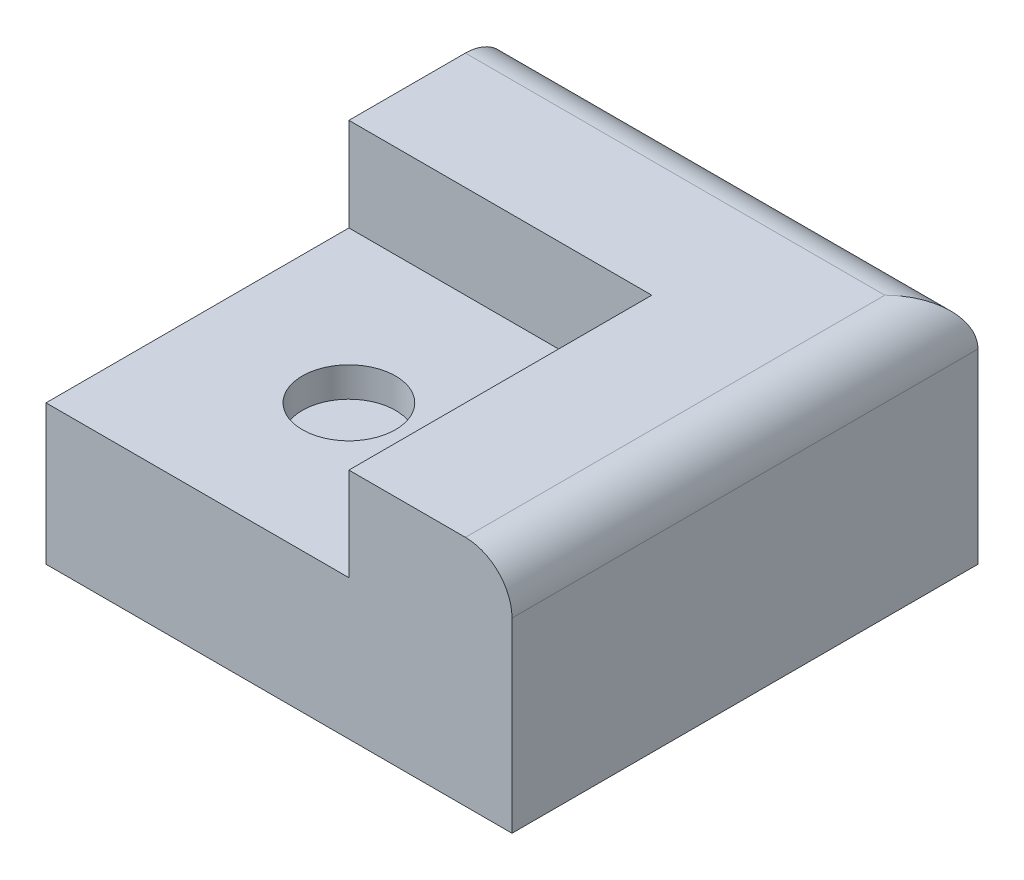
ISO-10303-21;
HEADER;
FILE_DESCRIPTION(('STEP AP214'),'2;1');
FILE_NAME('part.step','',(''),(''),'','','');
FILE_SCHEMA(('AUTOMOTIVE_DESIGN { 1 0 10303 214 1 1 1 1 }'));
ENDSEC;
DATA;
#1=APPLICATION_CONTEXT('core data for automotive mechanical design processes');
#2=APPLICATION_PROTOCOL_DEFINITION('international standard','automotive_design',2000,#1);
#3=PRODUCT_CONTEXT('',#1,'mechanical');
#4=PRODUCT('Part','Part','',(#3));
#5=PRODUCT_RELATED_PRODUCT_CATEGORY('part','',(#4));
#6=PRODUCT_DEFINITION_FORMATION('','',#4);
#7=PRODUCT_DEFINITION_CONTEXT('part definition',#1,'design');
#8=PRODUCT_DEFINITION('design','',#6,#7);
#9=PRODUCT_DEFINITION_SHAPE('','',#8);
#10=(LENGTH_UNIT() NAMED_UNIT(*) SI_UNIT(.MILLI.,.METRE.));
#11=(NAMED_UNIT(*) PLANE_ANGLE_UNIT() SI_UNIT($,.RADIAN.));
#12=(NAMED_UNIT(*) SI_UNIT($,.STERADIAN.) SOLID_ANGLE_UNIT());
#13=UNCERTAINTY_MEASURE_WITH_UNIT(LENGTH_MEASURE(1.E-05),#10,'distance_accuracy_value','');
#14=(GEOMETRIC_REPRESENTATION_CONTEXT(3) GLOBAL_UNCERTAINTY_ASSIGNED_CONTEXT((#13)) GLOBAL_UNIT_ASSIGNED_CONTEXT((#10,
#11,#12)) REPRESENTATION_CONTEXT('',''));
#15=CARTESIAN_POINT('',(0.,0.,0.));
#16=DIRECTION('',(0.,0.,1.));
#17=DIRECTION('',(1.,0.,0.));
#18=AXIS2_PLACEMENT_3D('',#15,#16,#17);
#19=CARTESIAN_POINT('',(-63.5,63.5,-63.5));
#20=DIRECTION('',(1.,0.,0.));
#21=DIRECTION('',(0.,0.,-1.));
#22=AXIS2_PLACEMENT_3D('',#19,#20,#21);
#23=PLANE('',#22);
#24=DIRECTION('',(0.,0.,1.));
#25=VECTOR('',#24,1.);
#26=CARTESIAN_POINT('',(-63.5,63.5,-63.5));
#27=LINE('',#26,#25);
#28=CARTESIAN_POINT('',(-63.5,63.5,-50.8));
#29=VERTEX_POINT('',#28);
#30=CARTESIAN_POINT('',(-63.5,63.5,-19.05));
#31=VERTEX_POINT('',#30);
#32=EDGE_CURVE('E118',#29,#31,#27,.T.);
#33=ORIENTED_EDGE('',*,*,#32,.F.);
#34=CARTESIAN_POINT('',(-63.5,50.8,-50.8));
#35=DIRECTION('',(1.,0.,0.));
#36=DIRECTION('',(0.,0.,-1.));
#37=AXIS2_PLACEMENT_3D('',#34,#35,#36);
#38=CIRCLE('',#37,12.7);
#39=CARTESIAN_POINT('',(-63.5,50.8,-63.5));
#40=VERTEX_POINT('',#39);
#41=EDGE_CURVE('E159',#29,#40,#38,.F.);
#42=ORIENTED_EDGE('',*,*,#41,.T.);
#43=DIRECTION('',(0.,-1.,0.));
#44=VECTOR('',#43,1.);
#45=CARTESIAN_POINT('',(-63.5,63.5,-63.5));
#46=LINE('',#45,#44);
#47=CARTESIAN_POINT('',(-63.5,0.,-63.5));
#48=VERTEX_POINT('',#47);
#49=EDGE_CURVE('E147',#40,#48,#46,.T.);
#50=ORIENTED_EDGE('',*,*,#49,.T.);
#51=DIRECTION('',(0.,0.,1.));
#52=VECTOR('',#51,1.);
#53=CARTESIAN_POINT('',(-63.5,0.,-63.5));
#54=LINE('',#53,#52);
#55=CARTESIAN_POINT('',(-63.5,0.,63.5));
#56=VERTEX_POINT('',#55);
#57=EDGE_CURVE('E130',#48,#56,#54,.T.);
#58=ORIENTED_EDGE('',*,*,#57,.T.);
#59=DIRECTION('',(0.,-1.,0.));
#60=VECTOR('',#59,1.);
#61=CARTESIAN_POINT('',(-63.5,63.5,63.5));
#62=LINE('',#61,#60);
#63=CARTESIAN_POINT('',(-63.5,38.1,63.5));
#64=VERTEX_POINT('',#63);
#65=EDGE_CURVE('E153',#64,#56,#62,.T.);
#66=ORIENTED_EDGE('',*,*,#65,.F.);
#67=DIRECTION('',(0.,0.,1.));
#68=VECTOR('',#67,1.);
#69=CARTESIAN_POINT('',(-63.5,38.1,63.5));
#70=LINE('',#69,#68);
#71=CARTESIAN_POINT('',(-63.5,38.1,-19.05));
#72=VERTEX_POINT('',#71);
#73=EDGE_CURVE('E119',#72,#64,#70,.T.);
#74=ORIENTED_EDGE('',*,*,#73,.F.);
#75=DIRECTION('',(0.,1.,0.));
#76=VECTOR('',#75,1.);
#77=CARTESIAN_POINT('',(-63.5,38.1,-19.05));
#78=LINE('',#77,#76);
#79=EDGE_CURVE('E103',#72,#31,#78,.T.);
#80=ORIENTED_EDGE('',*,*,#79,.T.);
#81=EDGE_LOOP('',(#33,#42,#50,#58,#66,#74,#80));
#82=FACE_BOUND('',#81,.T.);
#83=ADVANCED_FACE('F27',(#82),#23,.F.);
#84=CARTESIAN_POINT('',(-63.5,63.5,63.5));
#85=DIRECTION('',(0.,0.,-1.));
#86=DIRECTION('',(-1.,0.,0.));
#87=AXIS2_PLACEMENT_3D('',#84,#85,#86);
#88=PLANE('',#87);
#89=DIRECTION('',(0.,-1.,0.));
#90=VECTOR('',#89,1.);
#91=CARTESIAN_POINT('',(63.5,63.5,63.5));
#92=LINE('',#91,#90);
#93=CARTESIAN_POINT('',(63.5,50.8,63.5));
#94=VERTEX_POINT('',#93);
#95=CARTESIAN_POINT('',(63.5,0.,63.5));
#96=VERTEX_POINT('',#95);
#97=EDGE_CURVE('E151',#94,#96,#92,.T.);
#98=ORIENTED_EDGE('',*,*,#97,.F.);
#99=CARTESIAN_POINT('',(50.8,50.8,63.5));
#100=DIRECTION('',(0.,0.,-1.));
#101=DIRECTION('',(-1.,0.,0.));
#102=AXIS2_PLACEMENT_3D('',#99,#100,#101);
#103=CIRCLE('',#102,12.7);
#104=CARTESIAN_POINT('',(50.8,63.5,63.5));
#105=VERTEX_POINT('',#104);
#106=EDGE_CURVE('E11',#94,#105,#103,.F.);
#107=ORIENTED_EDGE('',*,*,#106,.T.);
#108=DIRECTION('',(1.,0.,0.));
#109=VECTOR('',#108,1.);
#110=CARTESIAN_POINT('',(-63.5,63.5,63.5));
#111=LINE('',#110,#109);
#112=CARTESIAN_POINT('',(19.05,63.5,63.5));
#113=VERTEX_POINT('',#112);
#114=EDGE_CURVE('E145',#113,#105,#111,.T.);
#115=ORIENTED_EDGE('',*,*,#114,.F.);
#116=DIRECTION('',(0.,1.,0.));
#117=VECTOR('',#116,1.);
#118=CARTESIAN_POINT('',(19.05,38.1,63.5));
#119=LINE('',#118,#117);
#120=CARTESIAN_POINT('',(19.05,38.1,63.5));
#121=VERTEX_POINT('',#120);
#122=EDGE_CURVE('E104',#121,#113,#119,.T.);
#123=ORIENTED_EDGE('',*,*,#122,.F.);
#124=DIRECTION('',(1.,0.,0.));
#125=VECTOR('',#124,1.);
#126=CARTESIAN_POINT('',(-63.5,38.1,63.5));
#127=LINE('',#126,#125);
#128=EDGE_CURVE('E121',#64,#121,#127,.T.);
#129=ORIENTED_EDGE('',*,*,#128,.F.);
#130=ORIENTED_EDGE('',*,*,#65,.T.);
#131=DIRECTION('',(1.,0.,0.));
#132=VECTOR('',#131,1.);
#133=CARTESIAN_POINT('',(-63.5,0.,63.5));
#134=LINE('',#133,#132);
#135=EDGE_CURVE('E135',#56,#96,#134,.T.);
#136=ORIENTED_EDGE('',*,*,#135,.T.);
#137=EDGE_LOOP('',(#98,#107,#115,#123,#129,#130,#136));
#138=FACE_BOUND('',#137,.T.);
#139=ADVANCED_FACE('F191',(#138),#88,.F.);
#140=CARTESIAN_POINT('',(63.5,63.5,-63.5));
#141=DIRECTION('',(-1.,0.,0.));
#142=DIRECTION('',(0.,0.,1.));
#143=AXIS2_PLACEMENT_3D('',#140,#141,#142);
#144=PLANE('',#143);
#145=DIRECTION('',(0.,-1.,0.));
#146=VECTOR('',#145,1.);
#147=CARTESIAN_POINT('',(63.5,63.5,-63.5));
#148=LINE('',#147,#146);
#149=CARTESIAN_POINT('',(63.5,50.8,-63.5));
#150=VERTEX_POINT('',#149);
#151=CARTESIAN_POINT('',(63.5,0.,-63.5));
#152=VERTEX_POINT('',#151);
#153=EDGE_CURVE('E149',#150,#152,#148,.T.);
#154=ORIENTED_EDGE('',*,*,#153,.F.);
#155=DIRECTION('',(0.,0.,-1.));
#156=VECTOR('',#155,1.);
#157=CARTESIAN_POINT('',(63.5,50.8,63.5));
#158=LINE('',#157,#156);
#159=EDGE_CURVE('E34',#150,#94,#158,.F.);
#160=ORIENTED_EDGE('',*,*,#159,.T.);
#161=ORIENTED_EDGE('',*,*,#97,.T.);
#162=DIRECTION('',(0.,0.,-1.));
#163=VECTOR('',#162,1.);
#164=CARTESIAN_POINT('',(63.5,0.,-63.5));
#165=LINE('',#164,#163);
#166=EDGE_CURVE('E138',#96,#152,#165,.T.);
#167=ORIENTED_EDGE('',*,*,#166,.T.);
#168=EDGE_LOOP('',(#154,#160,#161,#167));
#169=FACE_BOUND('',#168,.T.);
#170=ADVANCED_FACE('F209',(#169),#144,.F.);
#171=CARTESIAN_POINT('',(-63.5,63.5,-63.5));
#172=DIRECTION('',(0.,0.,1.));
#173=DIRECTION('',(1.,0.,0.));
#174=AXIS2_PLACEMENT_3D('',#171,#172,#173);
#175=PLANE('',#174);
#176=ORIENTED_EDGE('',*,*,#49,.F.);
#177=DIRECTION('',(-1.,0.,0.));
#178=VECTOR('',#177,1.);
#179=CARTESIAN_POINT('',(63.5,50.8,-63.5));
#180=LINE('',#179,#178);
#181=EDGE_CURVE('E48',#40,#150,#180,.F.);
#182=ORIENTED_EDGE('',*,*,#181,.T.);
#183=ORIENTED_EDGE('',*,*,#153,.T.);
#184=DIRECTION('',(-1.,0.,0.));
#185=VECTOR('',#184,1.);
#186=CARTESIAN_POINT('',(-63.5,0.,-63.5));
#187=LINE('',#186,#185);
#188=EDGE_CURVE('E141',#152,#48,#187,.T.);
#189=ORIENTED_EDGE('',*,*,#188,.T.);
#190=EDGE_LOOP('',(#176,#182,#183,#189));
#191=FACE_BOUND('',#190,.T.);
#192=ADVANCED_FACE('F164',(#191),#175,.F.);
#193=CARTESIAN_POINT('',(-63.5,63.5,63.5));
#194=DIRECTION('',(0.,1.,0.));
#195=DIRECTION('',(0.,0.,1.));
#196=AXIS2_PLACEMENT_3D('',#193,#194,#195);
#197=PLANE('',#196);
#198=DIRECTION('',(0.,0.,-1.));
#199=VECTOR('',#198,1.);
#200=CARTESIAN_POINT('',(50.8,63.5,-63.5));
#201=LINE('',#200,#199);
#202=CARTESIAN_POINT('',(50.8,63.5,-50.8));
#203=VERTEX_POINT('',#202);
#204=EDGE_CURVE('E155',#105,#203,#201,.T.);
#205=ORIENTED_EDGE('',*,*,#204,.T.);
#206=DIRECTION('',(-1.,0.,0.));
#207=VECTOR('',#206,1.);
#208=CARTESIAN_POINT('',(-63.5,63.5,-50.8));
#209=LINE('',#208,#207);
#210=EDGE_CURVE('E157',#203,#29,#209,.T.);
#211=ORIENTED_EDGE('',*,*,#210,.T.);
#212=ORIENTED_EDGE('',*,*,#32,.T.);
#213=DIRECTION('',(-1.,0.,0.));
#214=VECTOR('',#213,1.);
#215=CARTESIAN_POINT('',(-63.5,63.5,-19.05));
#216=LINE('',#215,#214);
#217=CARTESIAN_POINT('',(19.05,63.5,-19.05));
#218=VERTEX_POINT('',#217);
#219=EDGE_CURVE('E97',#218,#31,#216,.T.);
#220=ORIENTED_EDGE('',*,*,#219,.F.);
#221=DIRECTION('',(0.,0.,-1.));
#222=VECTOR('',#221,1.);
#223=CARTESIAN_POINT('',(19.05,63.5,63.5));
#224=LINE('',#223,#222);
#225=EDGE_CURVE('E107',#113,#218,#224,.T.);
#226=ORIENTED_EDGE('',*,*,#225,.F.);
#227=ORIENTED_EDGE('',*,*,#114,.T.);
#228=EDGE_LOOP('',(#205,#211,#212,#220,#226,#227));
#229=FACE_BOUND('',#228,.T.);
#230=ADVANCED_FACE('F115',(#229),#197,.T.);
#231=CARTESIAN_POINT('',(-63.5,0.,63.5));
#232=DIRECTION('',(0.,1.,0.));
#233=DIRECTION('',(0.,0.,1.));
#234=AXIS2_PLACEMENT_3D('',#231,#232,#233);
#235=PLANE('',#234);
#236=ORIENTED_EDGE('',*,*,#57,.F.);
#237=ORIENTED_EDGE('',*,*,#188,.F.);
#238=ORIENTED_EDGE('',*,*,#166,.F.);
#239=ORIENTED_EDGE('',*,*,#135,.F.);
#240=EDGE_LOOP('',(#236,#237,#238,#239));
#241=FACE_BOUND('',#240,.T.);
#242=ADVANCED_FACE('F194',(#241),#235,.F.);
#243=CARTESIAN_POINT('',(-63.5,38.1,-19.05));
#244=DIRECTION('',(0.,0.,-1.));
#245=DIRECTION('',(-1.,0.,0.));
#246=AXIS2_PLACEMENT_3D('',#243,#244,#245);
#247=PLANE('',#246);
#248=ORIENTED_EDGE('',*,*,#219,.T.);
#249=ORIENTED_EDGE('',*,*,#79,.F.);
#250=DIRECTION('',(-1.,0.,0.));
#251=VECTOR('',#250,1.);
#252=CARTESIAN_POINT('',(-63.5,38.1,-19.05));
#253=LINE('',#252,#251);
#254=CARTESIAN_POINT('',(19.05,38.1,-19.05));
#255=VERTEX_POINT('',#254);
#256=EDGE_CURVE('E100',#255,#72,#253,.T.);
#257=ORIENTED_EDGE('',*,*,#256,.F.);
#258=DIRECTION('',(0.,1.,0.));
#259=VECTOR('',#258,1.);
#260=CARTESIAN_POINT('',(19.05,38.1,-19.05));
#261=LINE('',#260,#259);
#262=EDGE_CURVE('E93',#255,#218,#261,.T.);
#263=ORIENTED_EDGE('',*,*,#262,.T.);
#264=EDGE_LOOP('',(#248,#249,#257,#263));
#265=FACE_BOUND('',#264,.T.);
#266=ADVANCED_FACE('F95',(#265),#247,.F.);
#267=CARTESIAN_POINT('',(19.05,38.1,63.5));
#268=DIRECTION('',(1.,0.,0.));
#269=DIRECTION('',(0.,0.,-1.));
#270=AXIS2_PLACEMENT_3D('',#267,#268,#269);
#271=PLANE('',#270);
#272=ORIENTED_EDGE('',*,*,#225,.T.);
#273=ORIENTED_EDGE('',*,*,#262,.F.);
#274=DIRECTION('',(0.,0.,-1.));
#275=VECTOR('',#274,1.);
#276=CARTESIAN_POINT('',(19.05,38.1,63.5));
#277=LINE('',#276,#275);
#278=EDGE_CURVE('E127',#121,#255,#277,.T.);
#279=ORIENTED_EDGE('',*,*,#278,.F.);
#280=ORIENTED_EDGE('',*,*,#122,.T.);
#281=EDGE_LOOP('',(#272,#273,#279,#280));
#282=FACE_BOUND('',#281,.T.);
#283=ADVANCED_FACE('F108',(#282),#271,.F.);
#284=CARTESIAN_POINT('',(-63.5,38.1,63.5));
#285=DIRECTION('',(0.,-1.,0.));
#286=DIRECTION('',(0.,0.,-1.));
#287=AXIS2_PLACEMENT_3D('',#284,#285,#286);
#288=PLANE('',#287);
#289=CARTESIAN_POINT('',(-22.225,38.1,22.225));
#290=DIRECTION('',(0.,1.,0.));
#291=DIRECTION('',(0.,0.,1.));
#292=AXIS2_PLACEMENT_3D('',#289,#290,#291);
#293=CIRCLE('',#292,12.7);
#294=CARTESIAN_POINT('',(-22.225,38.1,34.925));
#295=VERTEX_POINT('',#294);
#296=EDGE_CURVE('E174',#295,#295,#293,.T.);
#297=ORIENTED_EDGE('',*,*,#296,.F.);
#298=EDGE_LOOP('',(#297));
#299=FACE_BOUND('',#298,.T.);
#300=ORIENTED_EDGE('',*,*,#73,.T.);
#301=ORIENTED_EDGE('',*,*,#128,.T.);
#302=ORIENTED_EDGE('',*,*,#278,.T.);
#303=ORIENTED_EDGE('',*,*,#256,.T.);
#304=EDGE_LOOP('',(#300,#301,#302,#303));
#305=FACE_BOUND('',#304,.T.);
#306=ADVANCED_FACE('F182',(#299,#305),#288,.F.);
#307=CARTESIAN_POINT('',(50.8,50.8,63.5));
#308=DIRECTION('',(0.,0.,1.));
#309=DIRECTION('',(1.,0.,0.));
#310=AXIS2_PLACEMENT_3D('',#307,#308,#309);
#311=CYLINDRICAL_SURFACE('',#310,12.7);
#312=ORIENTED_EDGE('',*,*,#106,.F.);
#313=ORIENTED_EDGE('',*,*,#159,.F.);
#314=CARTESIAN_POINT('',(50.8,50.8,-50.8));
#315=DIRECTION('',(0.707106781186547,0.,0.707106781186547));
#316=DIRECTION('',(-0.707106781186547,0.,0.707106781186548));
#317=AXIS2_PLACEMENT_3D('',#314,#315,#316);
#318=ELLIPSE('',#317,17.9605122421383,12.7);
#319=EDGE_CURVE('E113',#203,#150,#318,.F.);
#320=ORIENTED_EDGE('',*,*,#319,.F.);
#321=ORIENTED_EDGE('',*,*,#204,.F.);
#322=EDGE_LOOP('',(#312,#313,#320,#321));
#323=FACE_BOUND('',#322,.T.);
#324=ADVANCED_FACE('F185',(#323),#311,.T.);
#325=CARTESIAN_POINT('',(-63.5,50.8,-50.8));
#326=DIRECTION('',(1.,0.,0.));
#327=DIRECTION('',(0.,0.,-1.));
#328=AXIS2_PLACEMENT_3D('',#325,#326,#327);
#329=CYLINDRICAL_SURFACE('',#328,12.7);
#330=ORIENTED_EDGE('',*,*,#319,.T.);
#331=ORIENTED_EDGE('',*,*,#181,.F.);
#332=ORIENTED_EDGE('',*,*,#41,.F.);
#333=ORIENTED_EDGE('',*,*,#210,.F.);
#334=EDGE_LOOP('',(#330,#331,#332,#333));
#335=FACE_BOUND('',#334,.T.);
#336=ADVANCED_FACE('F168',(#335),#329,.T.);
#337=CARTESIAN_POINT('',(-22.225,29.972,22.225));
#338=DIRECTION('',(0.,1.,0.));
#339=DIRECTION('',(0.,0.,1.));
#340=AXIS2_PLACEMENT_3D('',#337,#338,#339);
#341=CYLINDRICAL_SURFACE('',#340,12.7);
#342=CARTESIAN_POINT('',(-22.225,29.972,22.225));
#343=DIRECTION('',(0.,1.,0.));
#344=DIRECTION('',(0.,0.,1.));
#345=AXIS2_PLACEMENT_3D('',#342,#343,#344);
#346=CIRCLE('',#345,12.7);
#347=CARTESIAN_POINT('',(-22.225,29.972,34.925));
#348=VERTEX_POINT('',#347);
#349=EDGE_CURVE('E172',#348,#348,#346,.T.);
#350=ORIENTED_EDGE('',*,*,#349,.F.);
#351=EDGE_LOOP('',(#350));
#352=FACE_BOUND('',#351,.T.);
#353=ORIENTED_EDGE('',*,*,#296,.T.);
#354=EDGE_LOOP('',(#353));
#355=FACE_BOUND('',#354,.T.);
#356=ADVANCED_FACE('F180',(#352,#355),#341,.F.);
#357=CARTESIAN_POINT('',(-22.225,29.972,22.225));
#358=DIRECTION('',(0.,1.,0.));
#359=DIRECTION('',(0.,0.,1.));
#360=AXIS2_PLACEMENT_3D('',#357,#358,#359);
#361=PLANE('',#360);
#362=ORIENTED_EDGE('',*,*,#349,.T.);
#363=EDGE_LOOP('',(#362));
#364=FACE_BOUND('',#363,.T.);
#365=ADVANCED_FACE('F247',(#364),#361,.T.);
#366=CLOSED_SHELL('',(#83,#139,#170,#192,#230,#242,#266,#283,#306,#324,#336,#356,#365));
#367=MANIFOLD_SOLID_BREP('B2',#366);
#368=ADVANCED_BREP_SHAPE_REPRESENTATION('',(#18,#367),#14);
#369=SHAPE_DEFINITION_REPRESENTATION(#9,#368);
ENDSEC;
END-ISO-10303-21;
